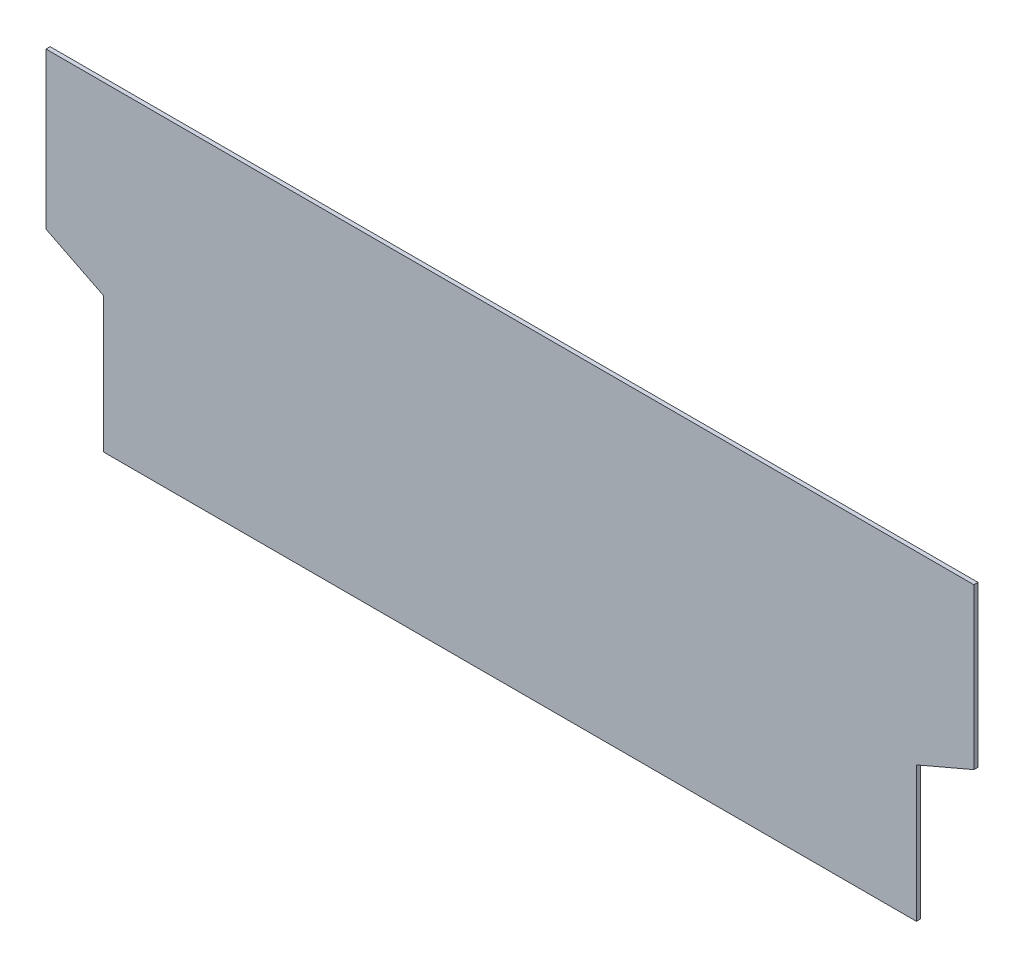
from build123d import *

# Parameters (mm, degrees)
EXTRUDE_1_DEPTH = 1


with BuildPart() as part:
    # Sketch 1 → Extrude 1 (new body)
    with BuildSketch(Plane.XY):
        Polygon((-97.072727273, 64.254545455), (-97.072727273, 26.254545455), (-83.072727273, 19.254545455), (-83.072727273, -13.745454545), (114.927272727, -13.745454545), (114.927272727, 19.254545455), (128.927272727, 25.254545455), (128.927272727, 64.254545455), align=None)
    extrude(amount=EXTRUDE_1_DEPTH)


solid = part.part
